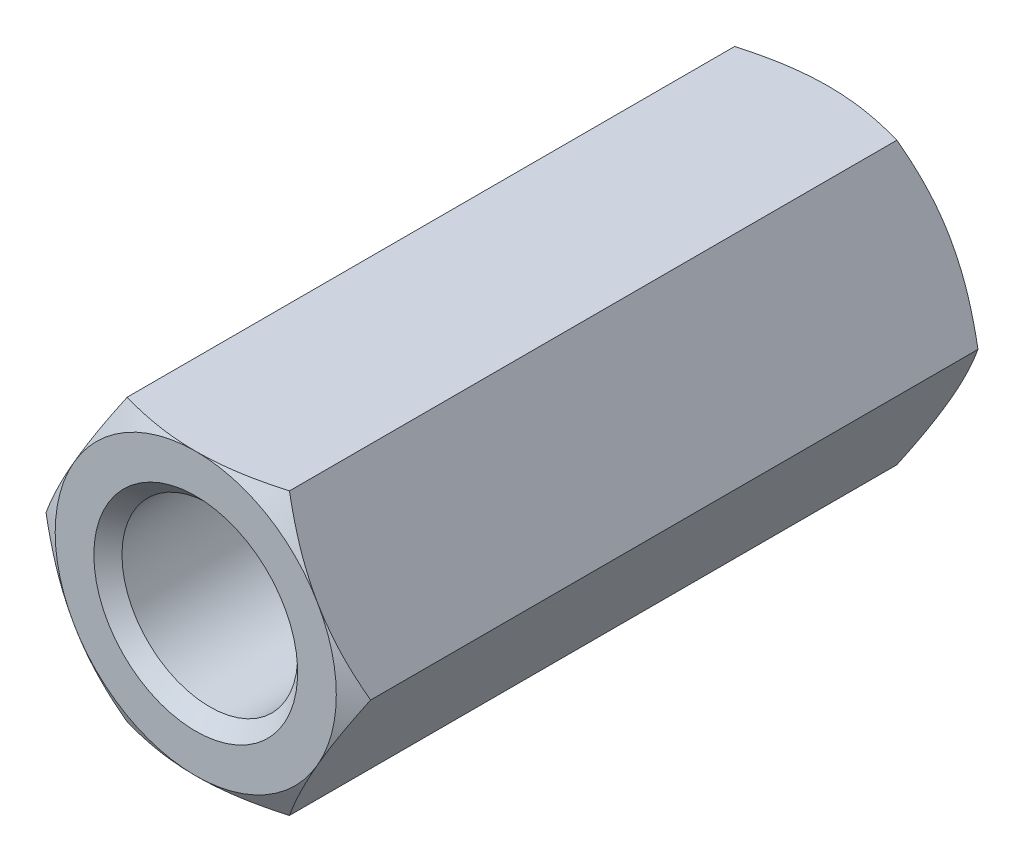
from build123d import *

# Parameters (mm, degrees)
BOSS_EXTRUDE1_DEPTH      = 9
SKETCH2_OUTSIDE_W        = 55.42
SKETCH2_OUTSIDE_H        = 54.182
SKETCH2_OUTSIDE_R        = 4
CUT_EXTRUDE1_DEPTH       = 11.878112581
CUT_EXTRUDE1_DRAFT       = -60
SKETCH3_R                = 2.5
SKETCH3_R_2              = 2.1
CUT_EXTRUDE2_DEPTH       = 9
SKETCH3_2_R              = 2.1
CUT_EXTRUDE3_DEPTH       = 10.2
CHAMFER1_SIZE            = 0.4
MIRROR1_COPY_1_SKETCH_W  = 55.42
MIRROR1_COPY_1_SKETCH_H  = 54.182
MIRROR1_COPY_1_SKETCH_R  = 4
MIRROR1_COPY_1_DEPTH     = 11.878112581
MIRROR1_COPY_1_DRAFT     = -60
CHAMFER1_OF_MIRROR1_SIZE = 0.4


with BuildPart() as part:
    # Sketch1 → Boss-Extrude1 (new body)
    with BuildSketch(Plane.XY):
        Polygon((2.309401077, 4), (-2.309401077, 4), (-4.618802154, 0), (-2.309401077, -4), (2.309401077, -4), (4.618802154, 0), align=None)
    boss_extrude1 = extrude(amount=-BOSS_EXTRUDE1_DEPTH)


with BuildPart() as cut_extrude1_tool:
    # Sketch2 outside → Cut-Extrude1 (with draft: the straight prism first)
    with BuildSketch(Plane(origin=(0, 0, -9), x_dir=(-1, 0, 0), z_dir=(0, 0, -1))):
        Rectangle(SKETCH2_OUTSIDE_W, SKETCH2_OUTSIDE_H)
        Circle(SKETCH2_OUTSIDE_R, mode=Mode.SUBTRACT)
    extrude(amount=-CUT_EXTRUDE1_DEPTH)
    # Cut-Extrude1: the draft: its side faces are tilted about the plane it starts from
    cut_extrude1_sides = [cut_extrude1_tool.faces().sort_by_distance(p)[0] for p in [
        (0, -27.091, -3.060943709),
        (-27.71, 0, -3.060943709),
        (0, 27.091, -3.060943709),
        (27.71, 0, -3.060943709),
        (4, 0, -3.060943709),
    ]]
    draft(cut_extrude1_sides, Plane(origin=(0, 0, -9), x_dir=(-1, 0, 0), z_dir=(0, 0, -1)), CUT_EXTRUDE1_DRAFT)


with BuildPart() as part_1:
    add(part.part)

    # Cut-Extrude1: cut by cut_extrude1_tool
    add(cut_extrude1_tool.part, mode=Mode.SUBTRACT)

    # Sketch3 → Cut-Extrude2 (cut)
    with BuildSketch(Plane(origin=(0, 0, -9), x_dir=(-1, 0, 0), z_dir=(0, 0, -1))):
        Circle(SKETCH3_R)
        Circle(SKETCH3_R_2, mode=Mode.SUBTRACT)
    cut_extrude2 = extrude(amount=-CUT_EXTRUDE2_DEPTH, mode=Mode.SUBTRACT)


with BuildPart() as cut_extrude2_piece_1:
    # of the separate pieces the step leaves, piece 1, a body of its own (cut_extrude2_pieces)
    add(part_1.part.solids().sort_by_distance((2.309401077, 4, 0))[0])

    # Chamfer1
    chamfer1_edges = [cut_extrude2_piece_1.edges().sort_by_distance(p)[0] for p in [
        (2.5, 0, -9),
    ]]
    chamfer(chamfer1_edges, length=CHAMFER1_SIZE)


with BuildPart() as cut_extrude2_piece_2:
    # of the separate pieces the step leaves, piece 2, a body of its own (cut_extrude2_pieces)
    add(part_1.part.solids().sort_by_distance((-2.1, 0, 0))[0])

    # Sketch3_2 → Cut-Extrude3 (cut)
    with BuildSketch(Plane(origin=(0, 0, -9), x_dir=(-1, 0, 0), z_dir=(0, 0, -1))):
        Circle(SKETCH3_2_R)
    cut_extrude3 = extrude(amount=-CUT_EXTRUDE3_DEPTH, mode=Mode.SUBTRACT)


with BuildPart() as cut_extrude2_piece_1_1:
    add(cut_extrude2_piece_1.part)

    # Mirror1: Boss-Extrude1, Cut-Extrude2, Cut-Extrude3 across plane
    add(boss_extrude1.mirror(Plane.XY))
    add(cut_extrude2.mirror(Plane.XY), mode=Mode.SUBTRACT)
    add(cut_extrude3.mirror(Plane.XY), mode=Mode.SUBTRACT)


with BuildPart() as mirror1_copy_1_tool:
    # Mirror1 copy 1 sketch → Mirror1 copy 1 (with draft: the straight prism first)
    with BuildSketch(Plane(origin=(0, 0, 9), x_dir=(-1, 0, 0), z_dir=(0, 0, 1))):
        Rectangle(MIRROR1_COPY_1_SKETCH_W, MIRROR1_COPY_1_SKETCH_H)
        Circle(MIRROR1_COPY_1_SKETCH_R, mode=Mode.SUBTRACT)
    extrude(amount=-MIRROR1_COPY_1_DEPTH)
    # Mirror1 copy 1: the draft: its side faces are tilted about the plane it starts from
    mirror1_copy_1_sides = [mirror1_copy_1_tool.faces().sort_by_distance(p)[0] for p in [
        (0, -27.091, 3.060943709),
        (-27.71, 0, 3.060943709),
        (0, 27.091, 3.060943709),
        (27.71, 0, 3.060943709),
        (4, 0, 3.060943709),
    ]]
    draft(mirror1_copy_1_sides, Plane(origin=(0, 0, 9), x_dir=(-1, 0, 0), z_dir=(0, 0, 1)), MIRROR1_COPY_1_DRAFT)


with BuildPart() as cut_extrude2_piece_1_2:
    add(cut_extrude2_piece_1_1.part)

    # Mirror1 copy 1: cut by mirror1_copy_1_tool
    add(mirror1_copy_1_tool.part, mode=Mode.SUBTRACT)

    # Chamfer1 of Mirror1
    chamfer1_of_mirror1_edges = [cut_extrude2_piece_1_2.edges().sort_by_distance(p)[0] for p in [
        (2.5, 0, 9),
    ]]
    chamfer(chamfer1_of_mirror1_edges, length=CHAMFER1_OF_MIRROR1_SIZE)


solid = cut_extrude2_piece_1_2.part
